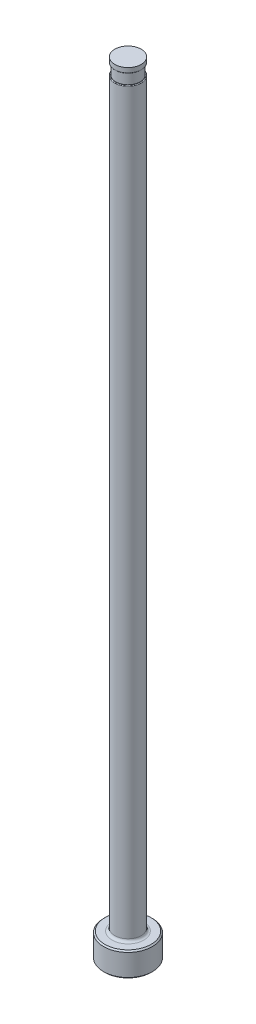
from build123d import *

# Parameters (mm, degrees)
CHAMFER1_SIZE     = 0.254
FILLET1_R         = 0.508
SKETCH2_W         = 0.2032
SKETCH2_H         = 2.032
D_SLOT_DEPTH      = 153.548755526
D_SLOT_DEPTH_BACK = 153.548755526
SKETCH5_W         = 0.00508
SKETCH5_H         = 1.016
FILLET2_R         = 0.127


with BuildPart() as part:
    # Sketch1 → Revolve1 (revolve)
    with BuildSketch(Plane.XY, mode=Mode.PRIVATE) as revolve1_sk:
        Polygon((0, 0), (-4.7625, 0), (-4.7625, 4.7498), (-2.57937, 4.7498), (-2.57937, 152.4), (0, 152.4), align=None)
    revolve(revolve1_sk.sketch.rotate(Axis((0, 259.958771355, 0), (0, -1, 0)), 270), axis=Axis((0, 259.958771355, 0), (0, -1, 0)))

    # Chamfer1
    chamfer1_edges = [part.edges().sort_by_distance(p)[0] for p in [
        (0, 4.7498, -4.7625),
        (0, 0, -4.7625),
    ]]
    chamfer(chamfer1_edges, length=CHAMFER1_SIZE)

    # Fillet1
    fillet1_edges = [part.edges().sort_by_distance(p)[0] for p in [
        (0, 4.7498, -2.57937),
    ]]
    fillet(fillet1_edges, radius=FILLET1_R)

    # Sketch2 → Vent Relief (revolve, cut)
    with BuildSketch(Plane.XY, mode=Mode.PRIVATE) as vent_relief_sk:
        with Locations((-2.47777, 150.368)):
            Rectangle(SKETCH2_W, SKETCH2_H)
    revolve(vent_relief_sk.sketch.rotate(Axis((0, 153.448281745, 0), (0, -1, 0)), 270), axis=Axis((0, 153.448281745, 0), (0, -1, 0)), mode=Mode.SUBTRACT)

    # Sketch3 → D-Slot (cut, two sides: drawn at the far end of the back side and taken through both)
    with BuildSketch(Plane.XY.offset(-D_SLOT_DEPTH_BACK)):
        with BuildLine():
            Line((-2.37617, 150.368), (-2.37617, 86.868))
            ThreePointArc((-2.37617, 86.868), (-2.427383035, 86.300038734), (-2.57937, 85.7504))
            Line((-2.57937, 85.7504), (-2.57937, 150.368))
            Line((-2.57937, 150.368), (-2.37617, 150.368))
        make_face()
    extrude(amount=D_SLOT_DEPTH + D_SLOT_DEPTH_BACK, mode=Mode.SUBTRACT)

    # Sketch5 → Vent Diameter (revolve, cut)
    with BuildSketch(Plane.XY, mode=Mode.PRIVATE) as vent_diameter_sk:
        with Locations((-2.57683, 151.892)):
            Rectangle(SKETCH5_W, SKETCH5_H)
    revolve(vent_diameter_sk.sketch.rotate(Axis((0, 152.687735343, 0), (0, -1, 0)), 90), axis=Axis((0, 152.687735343, 0), (0, -1, 0)), mode=Mode.SUBTRACT)

    # Fillet2
    fillet2_edges = [part.edges().sort_by_distance(p)[0] for p in [
        (2.149591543, 149.352, -1.425624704),
        (0, 151.384, 2.57429),
    ]]
    fillet(fillet2_edges, radius=FILLET2_R)


solid = part.part
